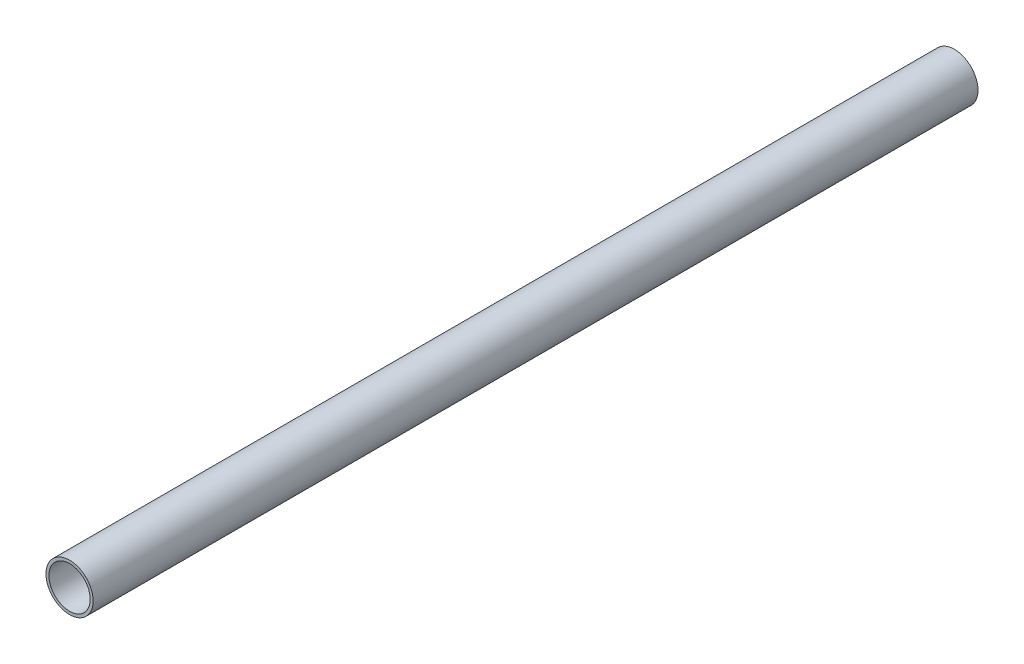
from build123d import *

# Parameters (mm, degrees)
SKETCH1_R           = 8
SKETCH1_R_2         = 7
BOSS_EXTRUDE1_DEPTH = 300


with BuildPart() as part:
    # Sketch1 → Boss-Extrude1 (new body)
    with BuildSketch(Plane.XY):
        Circle(SKETCH1_R)
        Circle(SKETCH1_R_2, mode=Mode.SUBTRACT)
    extrude(amount=BOSS_EXTRUDE1_DEPTH)


solid = part.part
